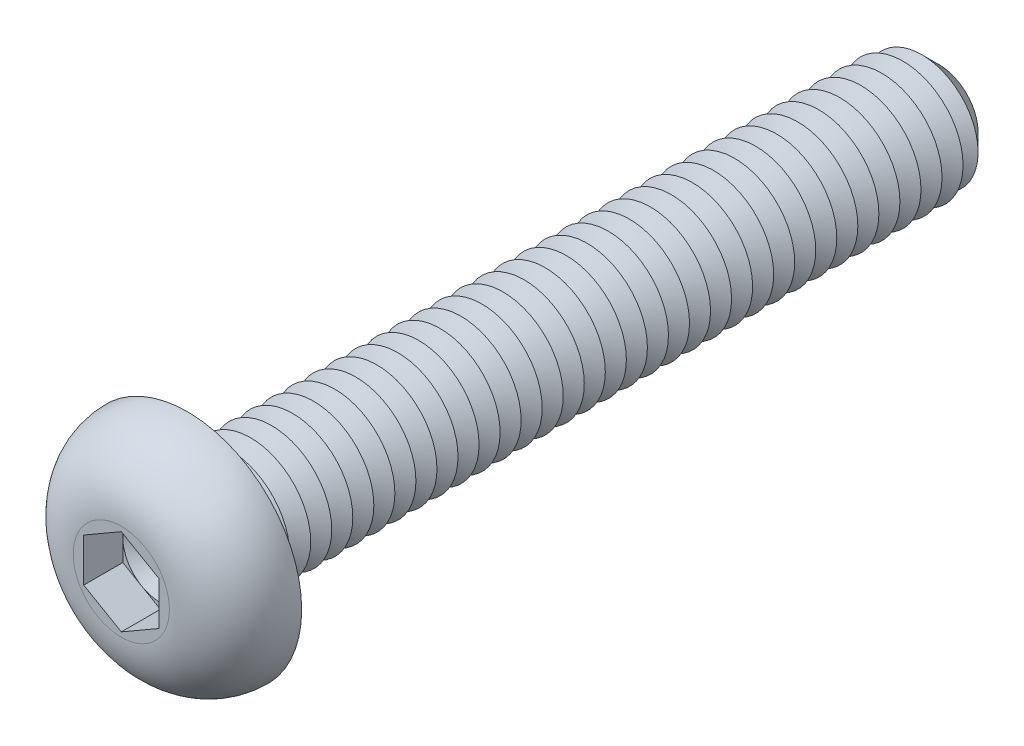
from build123d import *

# Parameters (mm, degrees)
CUT_EXTRUDE1_DEPTH  = 1.3
SKETCH4_R           = 2
BOSS_EXTRUDE1_DEPTH = 25
CHAMFER1_SIZE       = 0.7
LPATTERN1_COUNT     = 34
LPATTERN1_PITCH     = 0.7
FILLET2_R           = 0.3


with BuildPart() as part:
    # Sketch2 → Revolve1 (revolve)
    with BuildSketch(Plane(origin=(0, 0, 0), x_dir=(0, 0, -1), z_dir=(1, 0, 0)), mode=Mode.PRIVATE) as revolve1_sk:
        with BuildLine():
            Line((0, 0), (-2.2, 0))
            Line((-2.2, 0), (-2.2, 1.6))
            ThreePointArc((-2.2, 1.6), (-1.555634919, 3.155634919), (0, 3.8))
            Line((0, 3.8), (0, 0))
        make_face()
    revolve(revolve1_sk.sketch.rotate(Axis((0, 0, 47.934239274), (0, 0, -1)), 90), axis=Axis((0, 0, 47.934239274), (0, 0, -1)))

    # Sketch3 → Cut-Extrude1 (cut)
    with BuildSketch(Plane.XY.offset(2.2)):
        Polygon((0, 1.443375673), (-1.25, 0.721687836), (-1.25, -0.721687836), (0, -1.443375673), (1.25, -0.721687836), (1.25, 0.721687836), align=None)
    extrude(amount=-CUT_EXTRUDE1_DEPTH, mode=Mode.SUBTRACT)

    # Sketch4 → Boss-Extrude1 (add)
    with BuildSketch(Plane(origin=(0, 0, 0), x_dir=(-1, 0, 0), z_dir=(0, 0, -1))):
        with Locations(Location((0, 0, 0), (0, 0, 180))):
            Circle(SKETCH4_R)
    extrude(amount=BOSS_EXTRUDE1_DEPTH)

    # Chamfer1
    chamfer1_edges = [part.edges().sort_by_distance(p)[0] for p in [
        (-2, 0, -25),
    ]]
    chamfer(chamfer1_edges, length=CHAMFER1_SIZE)

    # Sketch5 → Cut-Revolve1 (revolve, cut)
    with BuildSketch(Plane(origin=(0, 0, 0), x_dir=(0, 0, -1), z_dir=(1, 0, 0)), mode=Mode.PRIVATE) as cut_revolve1_sk:
        Polygon((0.7, 2), (1.4, 2), (1.05, 1.393782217), align=None)
    cut_revolve1 = revolve(cut_revolve1_sk.sketch.rotate(Axis((0, 0, 47.934239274), (0, 0, -1)), 90), axis=Axis((0, 0, 47.934239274), (0, 0, -1)), mode=Mode.SUBTRACT)

    # LPattern1: Cut-Revolve1 ×34
    with Locations(*[(0, 0, -i * LPATTERN1_PITCH) for i in range(1, LPATTERN1_COUNT)]):
        add(cut_revolve1, mode=Mode.SUBTRACT)

    # Fillet2
    fillet2_edges = [part.edges().sort_by_distance(p)[0] for p in [
        (-2, 0, 0),
    ]]
    fillet(fillet2_edges, radius=FILLET2_R)

    # Cut-Extrude2 cone 1 section (on through the dimple's axis) → Cut-Extrude2 (revolve, cut)
    with BuildSketch(Plane(origin=(0, 0, 0.9), x_dir=(0, -1, 0), z_dir=(1, 0, 0))):
        Polygon((0, 0), (1.25, 0), (0, 0.721687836), align=None)
    revolve(axis=Axis((0, 0, 0.9), (0, 0, -1)), mode=Mode.SUBTRACT)


solid = part.part
